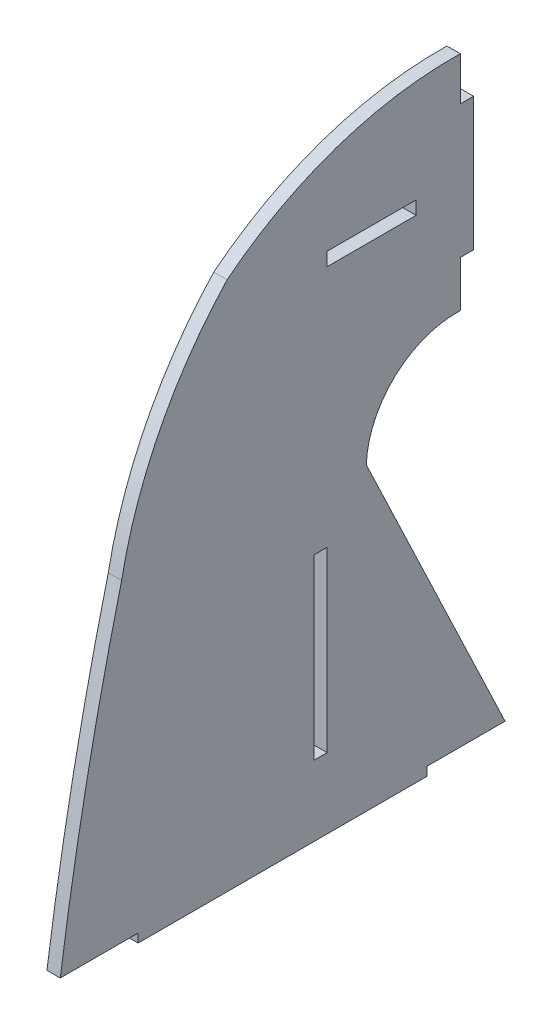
from build123d import *

# Parameters (mm, degrees)
ESQUISSE1_W        = 20
ESQUISSE1_H        = 3
ESQUISSE1_W_2      = 3
ESQUISSE1_H_2      = 40
BOSS_EXTRU_1_DEPTH = 3


with BuildPart() as part:
    # Esquisse1 → Boss.-Extru.1 (new body)
    with BuildSketch(Plane(origin=(0, 0, 0), x_dir=(0, 0, -1), z_dir=(1, 0, 0))):
        with BuildLine():
            Line((-50, -137.5), (-32.5, -137.5))
            Line((-32.5, -137.5), (-32.5, -139.45573955))
            Line((-32.5, -139.45573955), (32.5, -139.45573955))
            Line((32.5, -139.45573955), (32.5, -137.5))
            Line((32.5, -137.5), (50, -137.5))
            Line((50, -137.5), (18.785015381, -71.948532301))
            ThreePointArc((18.785015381, -71.948532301), (25.339003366, -57.864025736), (39.932622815, -52.539144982))
            Line((39.932622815, -52.539144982), (39.932622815, -42.175513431))
            Line((39.932622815, -42.175513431), (42.932622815, -42.175513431))
            Line((42.932622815, -42.175513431), (42.932622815, -12.275513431))
            Line((42.932622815, -12.275513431), (39.932622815, -12.275513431))
            Line((39.932622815, -12.275513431), (39.932622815, -2.5))
            ThreePointArc((39.932622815, -2.5), (12.169641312, -6.820649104), (-12.488073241, -20.290922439))
            ThreePointArc((-12.488073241, -20.290922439), (-27.632454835, -41.985964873), (-36.213300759, -67.01387416))
            ThreePointArc((-36.213300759, -67.01387416), (-44.038019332, -102.074766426), (-50, -137.5))
        make_face()
        with Locations((20, -27.5)):
            Rectangle(ESQUISSE1_W, ESQUISSE1_H, mode=Mode.SUBTRACT)
        with Locations((8.5, -103.61932618)):
            Rectangle(ESQUISSE1_W_2, ESQUISSE1_H_2, mode=Mode.SUBTRACT)
    extrude(amount=BOSS_EXTRU_1_DEPTH)


solid = part.part
